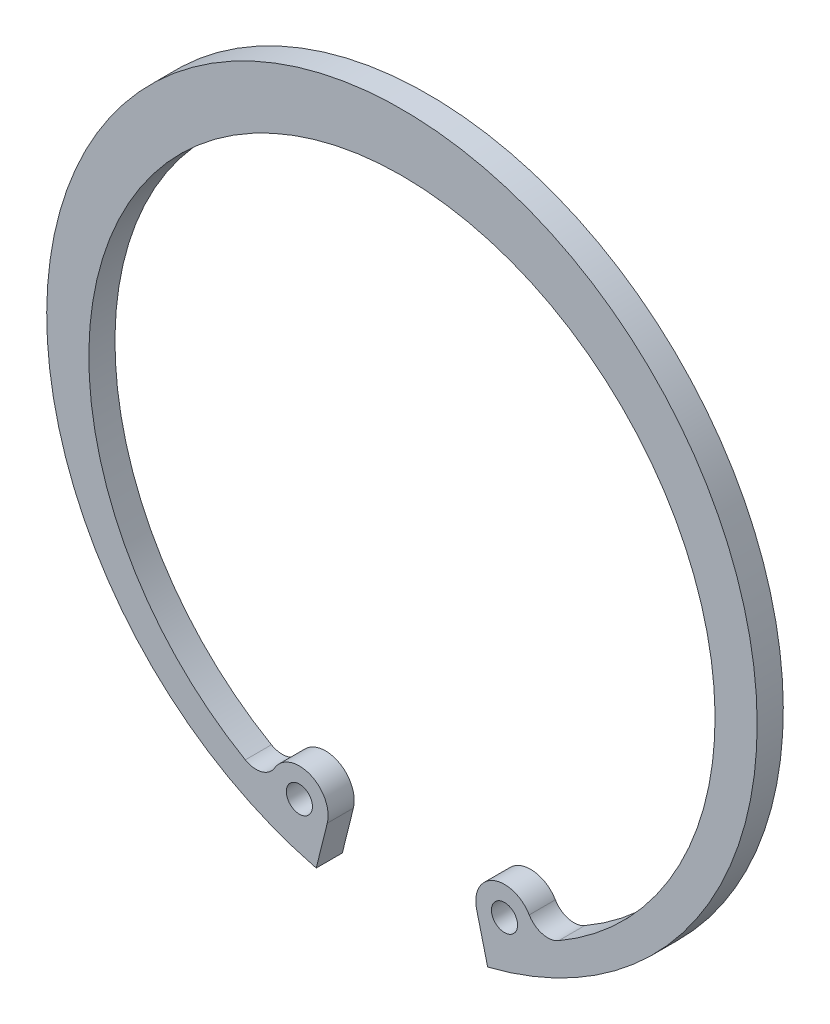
from build123d import *

# Parameters (mm, degrees)
BODYSKE_R  = 1.25
BODY_DEPTH = 2.5


with BuildPart() as part:
    # BodySke → Body (new body)
    with BuildSketch(Plane.XY):
        with BuildLine():
            Line((8.20417419, -32.995325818), (7.147917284, -28.747300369))
            ThreePointArc((7.147917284, -28.747300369), (8.7736125, -25.539212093), (12.183305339, -26.683200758))
            ThreePointArc((12.183305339, -26.683200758), (13.435413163, -27.627925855), (14.989931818, -27.418757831))
            ThreePointArc((14.989931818, -27.418757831), (0, 28.5), (-14.989931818, -27.418757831))
            ThreePointArc((-14.989931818, -27.418757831), (-13.435413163, -27.627925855), (-12.183305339, -26.683200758))
            ThreePointArc((-12.183305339, -26.683200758), (-8.7736125, -25.539212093), (-7.147917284, -28.747300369))
            Line((-7.147917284, -28.747300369), (-8.20417419, -32.995325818))
            ThreePointArc((-8.20417419, -32.995325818), (0, 34), (8.20417419, -32.995325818))
        make_face()
        with Locations((9.816656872, -28.083727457)):
            Circle(BODYSKE_R, mode=Mode.SUBTRACT)
        with Locations((-9.816656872, -28.083727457)):
            Circle(BODYSKE_R, mode=Mode.SUBTRACT)
    extrude(amount=-BODY_DEPTH)


solid = part.part
